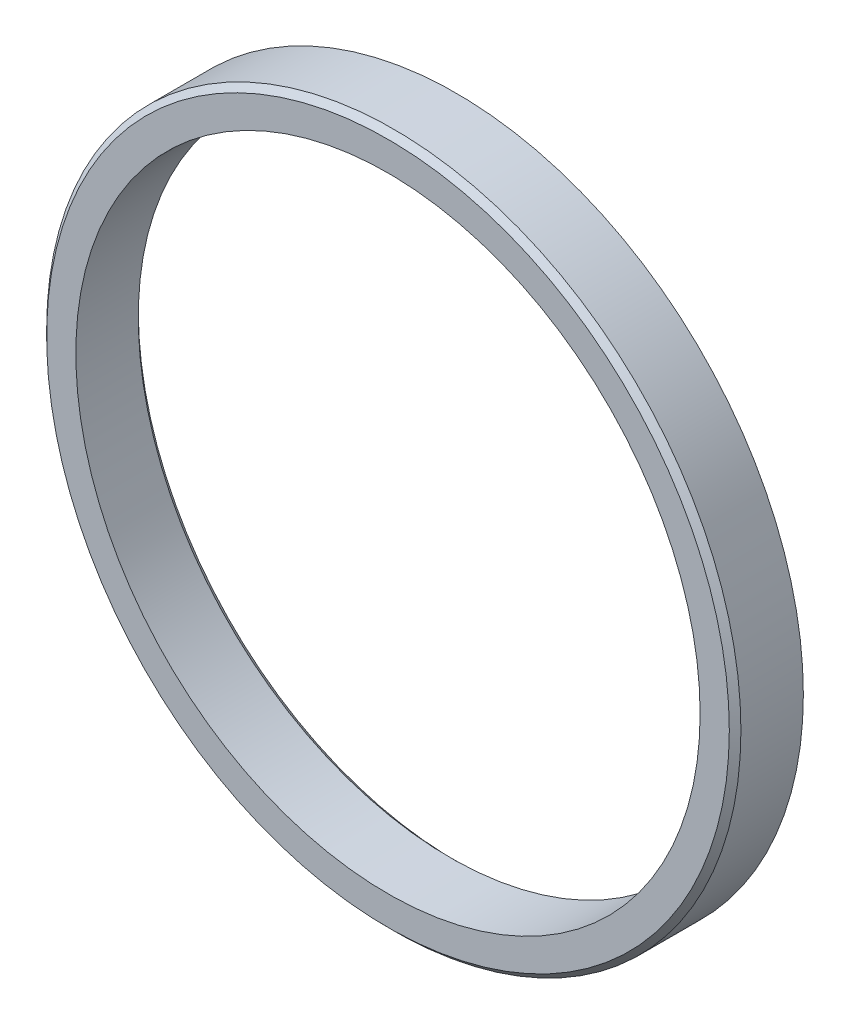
from build123d import *


with BuildPart() as part:
    # Sketch1 → Revolve1 (revolve)
    with BuildSketch(Plane(origin=(0, 0, 0), x_dir=(0, 0, -1), z_dir=(1, 0, 0)), mode=Mode.PRIVATE) as revolve1_sk:
        Polygon((-10.75, 107.5), (10.75, 107.5), (12.75, 109.5), (12.75, 119.55), (-8.75, 119.55), (-10.75, 117.55), align=None)
    revolve(revolve1_sk.sketch.rotate(Axis((0, 0, 66.622749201), (0, 0, -1)), 90), axis=Axis((0, 0, 66.622749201), (0, 0, -1)))


solid = part.part
